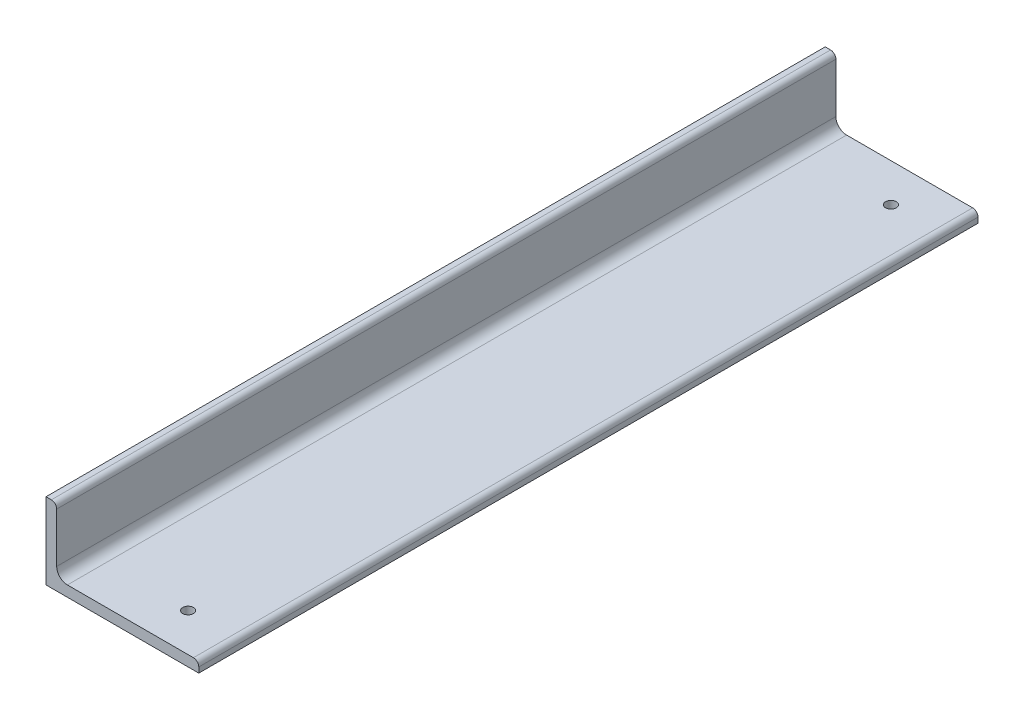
from build123d import *

# Parameters (mm, degrees)
EXTRUSION1_DEPTH           = 1020
TROU_TARAUD_M16X1_51_D     = 14
TROU_TARAUD_M16X1_51_DEPTH = 35
TROU_TARAUD_M16X1_51_TIP   = 4.206024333


with BuildPart() as part:
    # Esquisse1 → Extrusion1 (new body)
    with BuildSketch(Plane.XY):
        with BuildLine():
            Line((0, 0), (0, 100))
            Line((0, 100), (7, 100))
            ThreePointArc((7, 100), (11.949747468, 97.949747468), (14, 93))
            Line((14, 93), (14, 28))
            ThreePointArc((14, 28), (18.100505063, 18.100505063), (28, 14))
            Line((28, 14), (193, 14))
            ThreePointArc((193, 14), (197.949747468, 11.949747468), (200, 7))
            Line((200, 7), (200, 0))
            Line((200, 0), (0, 0))
        make_face()
    extrude(amount=EXTRUSION1_DEPTH)

    # Trou taraud_ M16x1.51
    with Locations(Plane.XZ):
        with Locations((136, 970), (136, 50)):
            Hole(TROU_TARAUD_M16X1_51_D / 2, depth=TROU_TARAUD_M16X1_51_DEPTH)
            with Locations((0, 0, -(TROU_TARAUD_M16X1_51_DEPTH + TROU_TARAUD_M16X1_51_TIP / 2))):  # 118° drill point
                Cone(0, TROU_TARAUD_M16X1_51_D / 2, TROU_TARAUD_M16X1_51_TIP, mode=Mode.SUBTRACT)


solid = part.part
